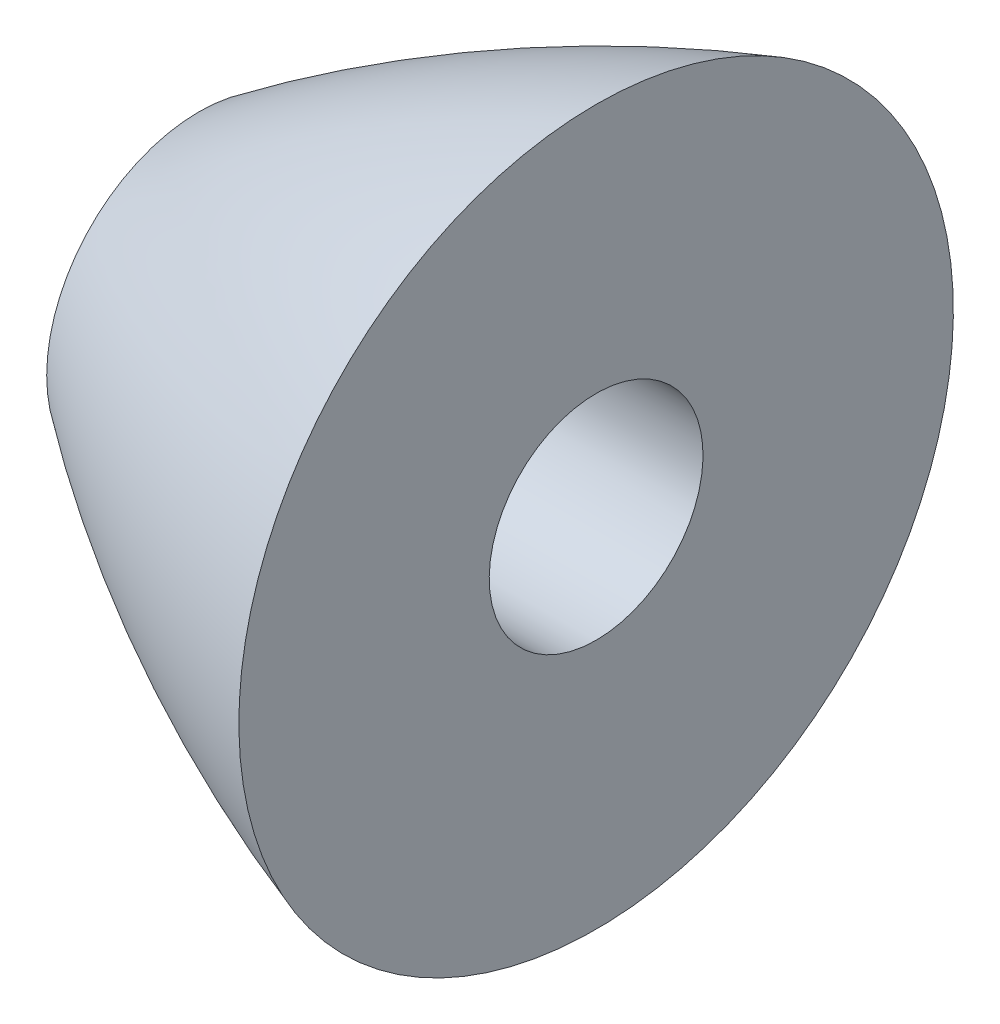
ISO-10303-21;
HEADER;
FILE_DESCRIPTION(('STEP AP214'),'2;1');
FILE_NAME('part.step','',(''),(''),'','','');
FILE_SCHEMA(('AUTOMOTIVE_DESIGN { 1 0 10303 214 1 1 1 1 }'));
ENDSEC;
DATA;
#1=APPLICATION_CONTEXT('core data for automotive mechanical design processes');
#2=APPLICATION_PROTOCOL_DEFINITION('international standard','automotive_design',2000,#1);
#3=PRODUCT_CONTEXT('',#1,'mechanical');
#4=PRODUCT('Part','Part','',(#3));
#5=PRODUCT_RELATED_PRODUCT_CATEGORY('part','',(#4));
#6=PRODUCT_DEFINITION_FORMATION('','',#4);
#7=PRODUCT_DEFINITION_CONTEXT('part definition',#1,'design');
#8=PRODUCT_DEFINITION('design','',#6,#7);
#9=PRODUCT_DEFINITION_SHAPE('','',#8);
#10=(LENGTH_UNIT() NAMED_UNIT(*) SI_UNIT(.MILLI.,.METRE.));
#11=(NAMED_UNIT(*) PLANE_ANGLE_UNIT() SI_UNIT($,.RADIAN.));
#12=(NAMED_UNIT(*) SI_UNIT($,.STERADIAN.) SOLID_ANGLE_UNIT());
#13=UNCERTAINTY_MEASURE_WITH_UNIT(LENGTH_MEASURE(1.E-05),#10,'distance_accuracy_value','');
#14=(GEOMETRIC_REPRESENTATION_CONTEXT(3) GLOBAL_UNCERTAINTY_ASSIGNED_CONTEXT((#13)) GLOBAL_UNIT_ASSIGNED_CONTEXT((#10,
#11,#12)) REPRESENTATION_CONTEXT('',''));
#15=CARTESIAN_POINT('',(0.,0.,0.));
#16=DIRECTION('',(0.,0.,1.));
#17=DIRECTION('',(1.,0.,0.));
#18=AXIS2_PLACEMENT_3D('',#15,#16,#17);
#19=CARTESIAN_POINT('',(-8.75,0.,0.));
#20=DIRECTION('',(-1.,0.,0.));
#21=DIRECTION('',(0.,-1.,0.));
#22=AXIS2_PLACEMENT_3D('',#19,#20,#21);
#23=PLANE('',#22);
#24=CARTESIAN_POINT('',(-8.75,0.,0.));
#25=DIRECTION('',(-1.,0.,0.));
#26=DIRECTION('',(0.,-1.,0.));
#27=AXIS2_PLACEMENT_3D('',#24,#25,#26);
#28=CIRCLE('',#27,2.);
#29=CARTESIAN_POINT('',(-8.75,-2.,0.));
#30=VERTEX_POINT('',#29);
#31=EDGE_CURVE('E93',#30,#30,#28,.T.);
#32=ORIENTED_EDGE('',*,*,#31,.T.);
#33=EDGE_LOOP('',(#32));
#34=FACE_BOUND('',#33,.T.);
#35=CARTESIAN_POINT('',(-8.74999999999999,0.,0.));
#36=DIRECTION('',(1.,0.,0.));
#37=DIRECTION('',(0.,1.,0.));
#38=AXIS2_PLACEMENT_3D('',#35,#36,#37);
#39=CIRCLE('',#38,6.68366432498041);
#40=CARTESIAN_POINT('',(-8.75,6.68366432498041,0.));
#41=VERTEX_POINT('',#40);
#42=EDGE_CURVE('E83',#41,#41,#39,.T.);
#43=ORIENTED_EDGE('',*,*,#42,.T.);
#44=EDGE_LOOP('',(#43));
#45=FACE_BOUND('',#44,.T.);
#46=ADVANCED_FACE('F51',(#34,#45),#23,.F.);
#47=CARTESIAN_POINT('',(0.,0.,0.));
#48=DIRECTION('',(1.,0.,0.));
#49=DIRECTION('',(0.,1.,0.));
#50=AXIS2_PLACEMENT_3D('',#47,#48,#49);
#51=DEGENERATE_TOROIDAL_SURFACE('',#50,19.3871526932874,27.5,.F.);
#52=CARTESIAN_POINT('',(-16.1789690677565,0.,0.));
#53=DIRECTION('',(1.,0.,0.));
#54=DIRECTION('',(0.,1.,0.));
#55=AXIS2_PLACEMENT_3D('',#52,#53,#54);
#56=CIRCLE('',#55,2.85);
#57=CARTESIAN_POINT('',(-16.1789690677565,2.84999999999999,0.));
#58=VERTEX_POINT('',#57);
#59=EDGE_CURVE('E88',#58,#58,#56,.F.);
#60=ORIENTED_EDGE('',*,*,#59,.F.);
#61=EDGE_LOOP('',(#60));
#62=FACE_BOUND('',#61,.T.);
#63=ORIENTED_EDGE('',*,*,#42,.F.);
#64=EDGE_LOOP('',(#63));
#65=FACE_BOUND('',#64,.T.);
#66=ADVANCED_FACE('F104',(#62,#65),#51,.F.);
#67=CARTESIAN_POINT('',(-19.5035460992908,0.,0.));
#68=DIRECTION('',(1.,0.,0.));
#69=DIRECTION('',(0.,0.,-1.));
#70=AXIS2_PLACEMENT_3D('',#67,#68,#69);
#71=CYLINDRICAL_SURFACE('',#70,2.);
#72=CARTESIAN_POINT('',(-11.75,0.,0.));
#73=DIRECTION('',(1.,0.,0.));
#74=DIRECTION('',(0.,0.,-1.));
#75=AXIS2_PLACEMENT_3D('',#72,#73,#74);
#76=CIRCLE('',#75,2.);
#77=CARTESIAN_POINT('',(-11.75,-0.624499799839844,-1.9));
#78=VERTEX_POINT('',#77);
#79=CARTESIAN_POINT('',(-11.75,0.62449979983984,-1.9));
#80=VERTEX_POINT('',#79);
#81=EDGE_CURVE('E78',#78,#80,#76,.T.);
#82=ORIENTED_EDGE('',*,*,#81,.F.);
#83=CARTESIAN_POINT('',(-13.,0.,0.));
#84=DIRECTION('',(-0.83541708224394,0.,-0.549616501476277));
#85=DIRECTION('',(0.549616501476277,0.,-0.83541708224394));
#86=AXIS2_PLACEMENT_3D('',#83,#84,#85);
#87=ELLIPSE('',#86,2.39401377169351,2.);
#88=EDGE_CURVE('E12',#78,#80,#87,.T.);
#89=ORIENTED_EDGE('',*,*,#88,.T.);
#90=EDGE_LOOP('',(#82,#89));
#91=FACE_BOUND('',#90,.T.);
#92=ORIENTED_EDGE('',*,*,#31,.F.);
#93=EDGE_LOOP('',(#92));
#94=FACE_BOUND('',#93,.T.);
#95=ADVANCED_FACE('F75',(#91,#94),#71,.F.);
#96=CARTESIAN_POINT('',(-17.28698064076,0.,0.));
#97=DIRECTION('',(1.,0.,0.));
#98=DIRECTION('',(0.,0.,-1.));
#99=AXIS2_PLACEMENT_3D('',#96,#97,#98);
#100=CYLINDRICAL_SURFACE('',#99,2.85);
#101=ORIENTED_EDGE('',*,*,#59,.T.);
#102=EDGE_LOOP('',(#101));
#103=FACE_BOUND('',#102,.T.);
#104=CARTESIAN_POINT('',(-11.75,0.,0.));
#105=DIRECTION('',(1.,0.,0.));
#106=DIRECTION('',(0.,0.,-1.));
#107=AXIS2_PLACEMENT_3D('',#104,#105,#106);
#108=CIRCLE('',#107,2.85);
#109=CARTESIAN_POINT('',(-11.75,-2.1242645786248,-1.9));
#110=VERTEX_POINT('',#109);
#111=CARTESIAN_POINT('',(-11.75,2.1242645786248,-1.9));
#112=VERTEX_POINT('',#111);
#113=EDGE_CURVE('E86',#110,#112,#108,.T.);
#114=ORIENTED_EDGE('',*,*,#113,.T.);
#115=CARTESIAN_POINT('',(-13.,0.,0.));
#116=DIRECTION('',(-0.83541708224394,0.,-0.549616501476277));
#117=DIRECTION('',(0.549616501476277,0.,-0.83541708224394));
#118=AXIS2_PLACEMENT_3D('',#115,#116,#117);
#119=ELLIPSE('',#118,3.41146962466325,2.85);
#120=EDGE_CURVE('E65',#110,#112,#119,.T.);
#121=ORIENTED_EDGE('',*,*,#120,.F.);
#122=EDGE_LOOP('',(#114,#121));
#123=FACE_BOUND('',#122,.T.);
#124=ADVANCED_FACE('F101',(#103,#123),#100,.F.);
#125=CARTESIAN_POINT('',(-11.75,0.,0.));
#126=DIRECTION('',(1.,0.,0.));
#127=DIRECTION('',(0.,0.,-1.));
#128=AXIS2_PLACEMENT_3D('',#125,#126,#127);
#129=PLANE('',#128);
#130=ORIENTED_EDGE('',*,*,#113,.F.);
#131=DIRECTION('',(0.,1.,0.));
#132=VECTOR('',#131,1.);
#133=CARTESIAN_POINT('',(-11.75,-6.68466432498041,-1.9));
#134=LINE('',#133,#132);
#135=EDGE_CURVE('E85',#110,#78,#134,.T.);
#136=ORIENTED_EDGE('',*,*,#135,.T.);
#137=ORIENTED_EDGE('',*,*,#81,.T.);
#138=DIRECTION('',(0.,1.,0.));
#139=VECTOR('',#138,1.);
#140=CARTESIAN_POINT('',(-11.75,0.,-1.9));
#141=LINE('',#140,#139);
#142=EDGE_CURVE('E58',#80,#112,#141,.T.);
#143=ORIENTED_EDGE('',*,*,#142,.T.);
#144=EDGE_LOOP('',(#130,#136,#137,#143));
#145=FACE_BOUND('',#144,.T.);
#146=ADVANCED_FACE('F84',(#145),#129,.F.);
#147=CARTESIAN_POINT('',(-9.07298211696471,-6.68466432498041,-5.96906718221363));
#148=DIRECTION('',(-0.83541708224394,0.,-0.549616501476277));
#149=DIRECTION('',(-0.549616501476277,0.,0.83541708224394));
#150=AXIS2_PLACEMENT_3D('',#147,#148,#149);
#151=PLANE('',#150);
#152=ORIENTED_EDGE('',*,*,#88,.F.);
#153=ORIENTED_EDGE('',*,*,#135,.F.);
#154=ORIENTED_EDGE('',*,*,#120,.T.);
#155=ORIENTED_EDGE('',*,*,#142,.F.);
#156=EDGE_LOOP('',(#152,#153,#154,#155));
#157=FACE_BOUND('',#156,.T.);
#158=ADVANCED_FACE('F79',(#157),#151,.T.);
#159=CLOSED_SHELL('',(#46,#66,#95,#124,#146,#158));
#160=MANIFOLD_SOLID_BREP('B2',#159);
#161=ADVANCED_BREP_SHAPE_REPRESENTATION('',(#18,#160),#14);
#162=SHAPE_DEFINITION_REPRESENTATION(#9,#161);
ENDSEC;
END-ISO-10303-21;
